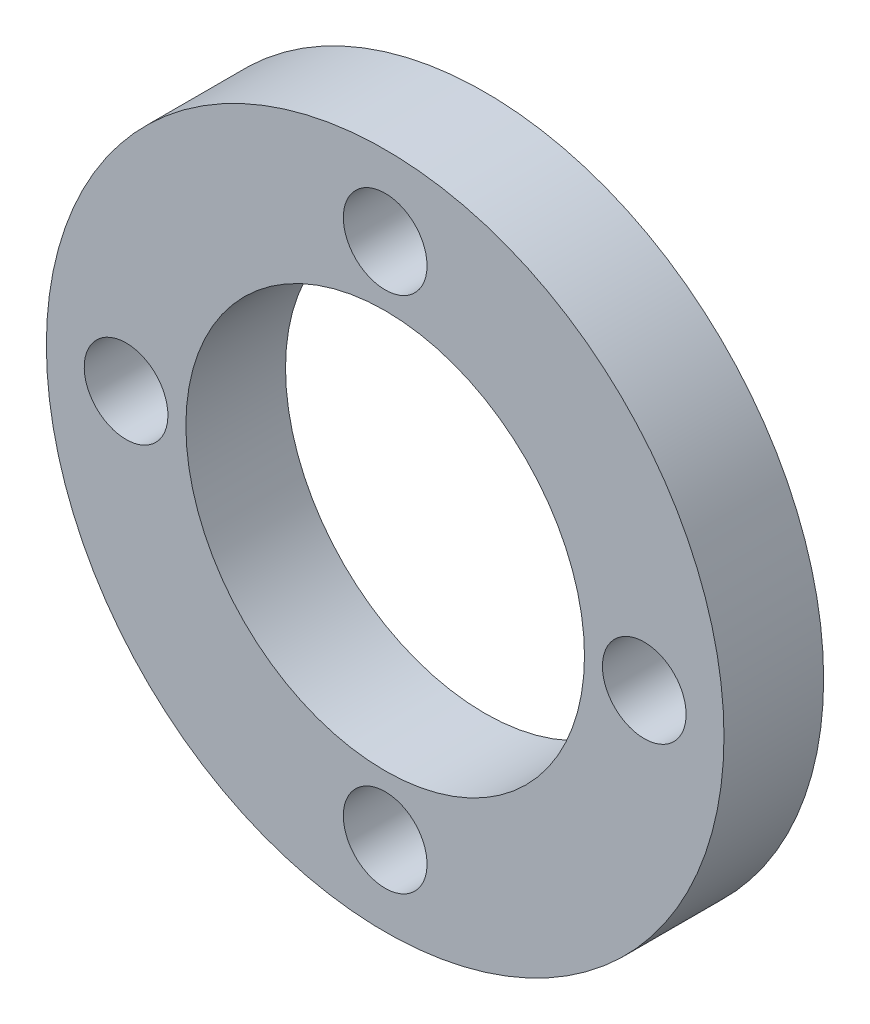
from build123d import *

# Parameters (mm, degrees)
ESQUISSE1_R                  = 17
ESQUISSE1_R_2                = 10
EXTRUSION1_DEPTH             = 5
ESQUISSE2_R                  = 2.1
ENL_V_MAT_EXTRU_1_DEPTH      = 25.556058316
R_P_TITION_CIRCULAIRE1_COUNT = 4


with BuildPart() as part:
    # Esquisse1 → Extrusion1 (new body)
    with BuildSketch(Plane.XY):
        Circle(ESQUISSE1_R)
        Circle(ESQUISSE1_R_2, mode=Mode.SUBTRACT)
    extrude(amount=EXTRUSION1_DEPTH)

    # Esquisse2 → Enl_v. mat.-Extru.1 (cut, through all)
    with BuildSketch(Plane.XY.offset(5)):
        with Locations((0, 13)):
            Circle(ESQUISSE2_R)
    enl_v_mat_extru_1 = extrude(amount=-ENL_V_MAT_EXTRU_1_DEPTH, mode=Mode.SUBTRACT)

    # R_p_tition circulaire1: Enl_v. mat.-Extru.1 ×4 about axis
    r_p_tition_circulaire1_axis = Axis((0, 0, 0), (0, 0, 1))
    for i in range(1, R_P_TITION_CIRCULAIRE1_COUNT):
        add(enl_v_mat_extru_1.rotate(r_p_tition_circulaire1_axis, i * 360 / R_P_TITION_CIRCULAIRE1_COUNT), mode=Mode.SUBTRACT)


solid = part.part
